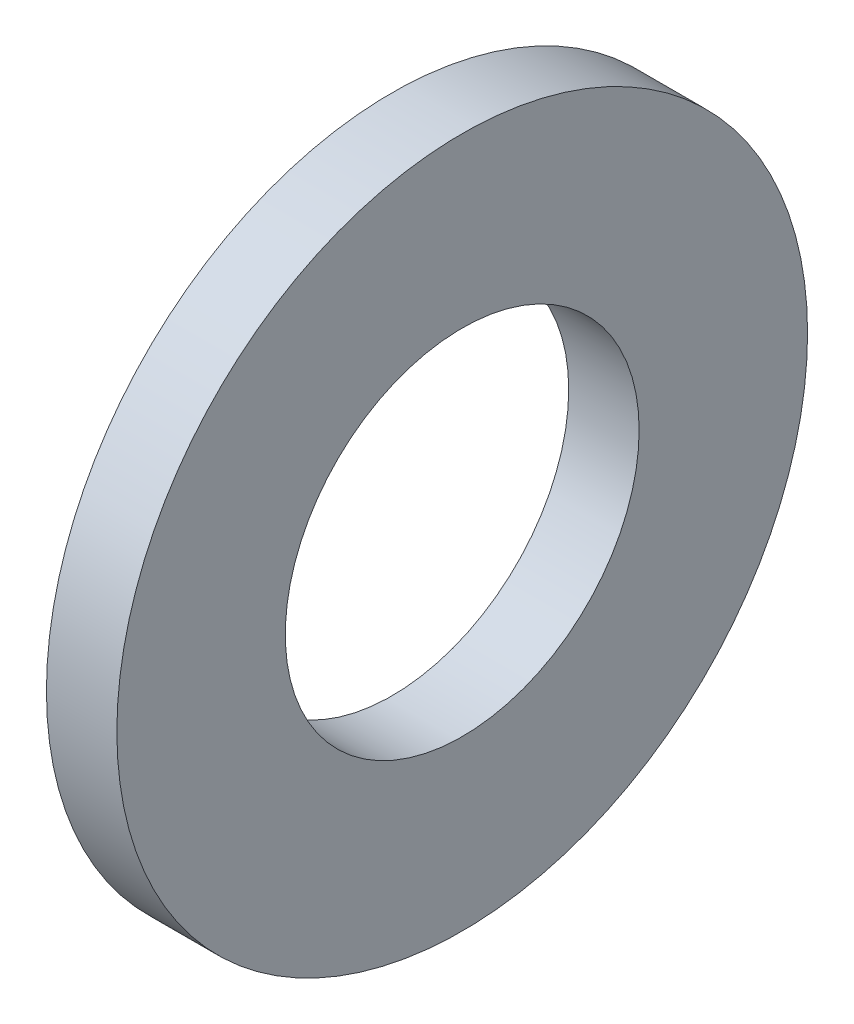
from build123d import *

# Parameters (mm, degrees)
SKETCH1_R          = 5.885
SKETCH1_R_2        = 3.015
BASE_EXTRUDE_DEPTH = 1.2


with BuildPart() as part:
    # Sketch1 → Base-Extrude (new body)
    with BuildSketch(Plane(origin=(0, 0, 0), x_dir=(0, 0, -1), z_dir=(1, 0, 0))):
        Circle(SKETCH1_R)
        Circle(SKETCH1_R_2, mode=Mode.SUBTRACT)
    extrude(amount=BASE_EXTRUDE_DEPTH)


solid = part.part
